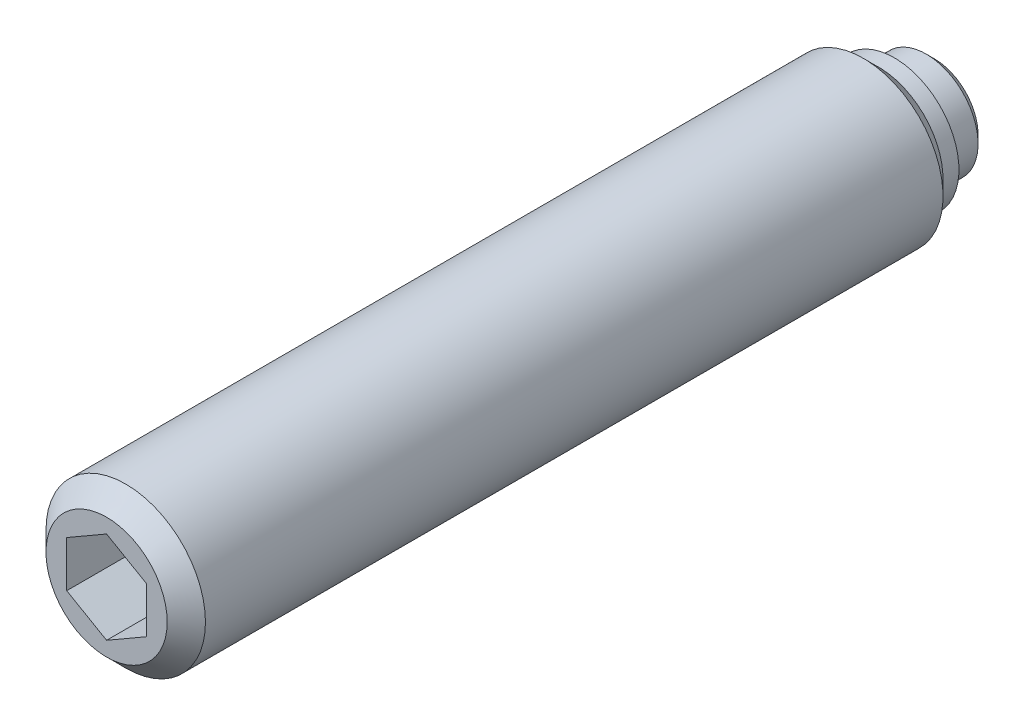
ISO-10303-21;
HEADER;
FILE_DESCRIPTION(('STEP AP214'),'2;1');
FILE_NAME('part.step','',(''),(''),'','','');
FILE_SCHEMA(('AUTOMOTIVE_DESIGN { 1 0 10303 214 1 1 1 1 }'));
ENDSEC;
DATA;
#1=APPLICATION_CONTEXT('core data for automotive mechanical design processes');
#2=APPLICATION_PROTOCOL_DEFINITION('international standard','automotive_design',2000,#1);
#3=PRODUCT_CONTEXT('',#1,'mechanical');
#4=PRODUCT('Part','Part','',(#3));
#5=PRODUCT_RELATED_PRODUCT_CATEGORY('part','',(#4));
#6=PRODUCT_DEFINITION_FORMATION('','',#4);
#7=PRODUCT_DEFINITION_CONTEXT('part definition',#1,'design');
#8=PRODUCT_DEFINITION('design','',#6,#7);
#9=PRODUCT_DEFINITION_SHAPE('','',#8);
#10=(LENGTH_UNIT() NAMED_UNIT(*) SI_UNIT(.MILLI.,.METRE.));
#11=(NAMED_UNIT(*) PLANE_ANGLE_UNIT() SI_UNIT($,.RADIAN.));
#12=(NAMED_UNIT(*) SI_UNIT($,.STERADIAN.) SOLID_ANGLE_UNIT());
#13=UNCERTAINTY_MEASURE_WITH_UNIT(LENGTH_MEASURE(1.E-05),#10,'distance_accuracy_value','');
#14=(GEOMETRIC_REPRESENTATION_CONTEXT(3) GLOBAL_UNCERTAINTY_ASSIGNED_CONTEXT((#13)) GLOBAL_UNIT_ASSIGNED_CONTEXT((#10,
#11,#12)) REPRESENTATION_CONTEXT('',''));
#15=CARTESIAN_POINT('',(0.,0.,0.));
#16=DIRECTION('',(0.,0.,1.));
#17=DIRECTION('',(1.,0.,0.));
#18=AXIS2_PLACEMENT_3D('',#15,#16,#17);
#19=CARTESIAN_POINT('',(0.,0.,0.));
#20=DIRECTION('',(0.,0.,-1.));
#21=DIRECTION('',(-1.,0.,0.));
#22=AXIS2_PLACEMENT_3D('',#19,#20,#21);
#23=CYLINDRICAL_SURFACE('',#22,3.25);
#24=CARTESIAN_POINT('',(0.,0.,0.5));
#25=DIRECTION('',(0.,0.,-1.));
#26=DIRECTION('',(-1.,0.,0.));
#27=AXIS2_PLACEMENT_3D('',#24,#25,#26);
#28=CIRCLE('',#27,3.25);
#29=CARTESIAN_POINT('',(-3.25,0.,0.5));
#30=VERTEX_POINT('',#29);
#31=EDGE_CURVE('E133',#30,#30,#28,.T.);
#32=ORIENTED_EDGE('',*,*,#31,.F.);
#33=EDGE_LOOP('',(#32));
#34=FACE_BOUND('',#33,.T.);
#35=CARTESIAN_POINT('',(0.,0.,2.5));
#36=DIRECTION('',(0.,0.,-1.));
#37=DIRECTION('',(-1.,0.,0.));
#38=AXIS2_PLACEMENT_3D('',#35,#36,#37);
#39=CIRCLE('',#38,3.25);
#40=CARTESIAN_POINT('',(-3.25,0.,2.5));
#41=VERTEX_POINT('',#40);
#42=EDGE_CURVE('E127',#41,#41,#39,.T.);
#43=ORIENTED_EDGE('',*,*,#42,.T.);
#44=EDGE_LOOP('',(#43));
#45=FACE_BOUND('',#44,.T.);
#46=ADVANCED_FACE('F14',(#34,#45),#23,.T.);
#47=CARTESIAN_POINT('',(0.,0.,0.5));
#48=DIRECTION('',(0.,0.,1.));
#49=DIRECTION('',(1.,0.,0.));
#50=AXIS2_PLACEMENT_3D('',#47,#48,#49);
#51=CONICAL_SURFACE('',#50,3.25,0.785398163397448);
#52=CARTESIAN_POINT('',(0.,0.,0.));
#53=DIRECTION('',(0.,0.,-1.));
#54=DIRECTION('',(-1.,0.,0.));
#55=AXIS2_PLACEMENT_3D('',#52,#53,#54);
#56=CIRCLE('',#55,2.75);
#57=CARTESIAN_POINT('',(-2.75,0.,0.));
#58=VERTEX_POINT('',#57);
#59=EDGE_CURVE('E130',#58,#58,#56,.T.);
#60=ORIENTED_EDGE('',*,*,#59,.F.);
#61=EDGE_LOOP('',(#60));
#62=FACE_BOUND('',#61,.T.);
#63=ORIENTED_EDGE('',*,*,#31,.T.);
#64=EDGE_LOOP('',(#63));
#65=FACE_BOUND('',#64,.T.);
#66=ADVANCED_FACE('F159',(#62,#65),#51,.T.);
#67=CARTESIAN_POINT('',(0.,2.75,0.));
#68=DIRECTION('',(0.,0.,1.));
#69=DIRECTION('',(1.,0.,0.));
#70=AXIS2_PLACEMENT_3D('',#67,#68,#69);
#71=PLANE('',#70);
#72=ORIENTED_EDGE('',*,*,#59,.T.);
#73=EDGE_LOOP('',(#72));
#74=FACE_BOUND('',#73,.T.);
#75=ADVANCED_FACE('F165',(#74),#71,.F.);
#76=CARTESIAN_POINT('',(0.,0.,2.5));
#77=DIRECTION('',(0.,0.,-1.));
#78=DIRECTION('',(-1.,0.,0.));
#79=AXIS2_PLACEMENT_3D('',#76,#77,#78);
#80=CYLINDRICAL_SURFACE('',#79,5.);
#81=CARTESIAN_POINT('',(0.,0.,4.45));
#82=DIRECTION('',(0.,0.,-1.));
#83=DIRECTION('',(-1.,0.,0.));
#84=AXIS2_PLACEMENT_3D('',#81,#82,#83);
#85=CIRCLE('',#84,5.);
#86=CARTESIAN_POINT('',(-5.,0.,4.45));
#87=VERTEX_POINT('',#86);
#88=EDGE_CURVE('E9',#87,#87,#85,.T.);
#89=ORIENTED_EDGE('',*,*,#88,.F.);
#90=EDGE_LOOP('',(#89));
#91=FACE_BOUND('',#90,.T.);
#92=CARTESIAN_POINT('',(0.,0.,50.7));
#93=DIRECTION('',(0.,0.,1.));
#94=DIRECTION('',(1.,0.,0.));
#95=AXIS2_PLACEMENT_3D('',#92,#93,#94);
#96=CIRCLE('',#95,5.);
#97=CARTESIAN_POINT('',(5.,0.,50.7));
#98=VERTEX_POINT('',#97);
#99=EDGE_CURVE('E124',#98,#98,#96,.T.);
#100=ORIENTED_EDGE('',*,*,#99,.F.);
#101=EDGE_LOOP('',(#100));
#102=FACE_BOUND('',#101,.T.);
#103=ADVANCED_FACE('F16',(#91,#102),#80,.T.);
#104=CARTESIAN_POINT('',(0.,4.05,2.5));
#105=DIRECTION('',(0.,0.,1.));
#106=DIRECTION('',(1.,0.,0.));
#107=AXIS2_PLACEMENT_3D('',#104,#105,#106);
#108=PLANE('',#107);
#109=CARTESIAN_POINT('',(0.,0.,2.5));
#110=DIRECTION('',(0.,0.,-1.));
#111=DIRECTION('',(-1.,0.,0.));
#112=AXIS2_PLACEMENT_3D('',#109,#110,#111);
#113=CIRCLE('',#112,4.05);
#114=CARTESIAN_POINT('',(-4.05,0.,2.5));
#115=VERTEX_POINT('',#114);
#116=EDGE_CURVE('E136',#115,#115,#113,.T.);
#117=ORIENTED_EDGE('',*,*,#116,.T.);
#118=EDGE_LOOP('',(#117));
#119=FACE_BOUND('',#118,.T.);
#120=ORIENTED_EDGE('',*,*,#42,.F.);
#121=EDGE_LOOP('',(#120));
#122=FACE_BOUND('',#121,.T.);
#123=ADVANCED_FACE('F156',(#119,#122),#108,.F.);
#124=CARTESIAN_POINT('',(0.,0.,2.5));
#125=DIRECTION('',(0.,0.,-1.));
#126=DIRECTION('',(-1.,0.,0.));
#127=AXIS2_PLACEMENT_3D('',#124,#125,#126);
#128=CYLINDRICAL_SURFACE('',#127,4.05);
#129=CARTESIAN_POINT('',(0.,0.,3.5));
#130=DIRECTION('',(0.,0.,-1.));
#131=DIRECTION('',(-1.,0.,0.));
#132=AXIS2_PLACEMENT_3D('',#129,#130,#131);
#133=CIRCLE('',#132,4.05);
#134=CARTESIAN_POINT('',(-4.05,0.,3.5));
#135=VERTEX_POINT('',#134);
#136=EDGE_CURVE('E22',#135,#135,#133,.T.);
#137=ORIENTED_EDGE('',*,*,#136,.T.);
#138=EDGE_LOOP('',(#137));
#139=FACE_BOUND('',#138,.T.);
#140=ORIENTED_EDGE('',*,*,#116,.F.);
#141=EDGE_LOOP('',(#140));
#142=FACE_BOUND('',#141,.T.);
#143=ADVANCED_FACE('F141',(#139,#142),#128,.T.);
#144=CARTESIAN_POINT('',(0.,0.,4.45));
#145=DIRECTION('',(0.,0.,1.));
#146=DIRECTION('',(1.,0.,0.));
#147=AXIS2_PLACEMENT_3D('',#144,#145,#146);
#148=CONICAL_SURFACE('',#147,5.,0.785398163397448);
#149=ORIENTED_EDGE('',*,*,#88,.T.);
#150=EDGE_LOOP('',(#149));
#151=FACE_BOUND('',#150,.T.);
#152=ORIENTED_EDGE('',*,*,#136,.F.);
#153=EDGE_LOOP('',(#152));
#154=FACE_BOUND('',#153,.T.);
#155=ADVANCED_FACE('F144',(#151,#154),#148,.T.);
#156=CARTESIAN_POINT('',(0.,-3.8,51.9));
#157=DIRECTION('',(0.,0.,1.));
#158=DIRECTION('',(1.,0.,0.));
#159=AXIS2_PLACEMENT_3D('',#156,#157,#158);
#160=PLANE('',#159);
#161=DIRECTION('',(0.866025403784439,-0.5,0.));
#162=VECTOR('',#161,1.);
#163=CARTESIAN_POINT('',(-2.5,-1.44337567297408,51.9));
#164=LINE('',#163,#162);
#165=CARTESIAN_POINT('',(-2.5,-1.44337567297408,51.9));
#166=VERTEX_POINT('',#165);
#167=CARTESIAN_POINT('',(0.,-2.88675134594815,51.9));
#168=VERTEX_POINT('',#167);
#169=EDGE_CURVE('E29',#166,#168,#164,.T.);
#170=ORIENTED_EDGE('',*,*,#169,.F.);
#171=DIRECTION('',(0.,-1.,0.));
#172=VECTOR('',#171,1.);
#173=CARTESIAN_POINT('',(-2.5,1.44337567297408,51.9));
#174=LINE('',#173,#172);
#175=CARTESIAN_POINT('',(-2.5,1.44337567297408,51.9));
#176=VERTEX_POINT('',#175);
#177=EDGE_CURVE('E112',#176,#166,#174,.T.);
#178=ORIENTED_EDGE('',*,*,#177,.F.);
#179=DIRECTION('',(-0.866025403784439,-0.5,0.));
#180=VECTOR('',#179,1.);
#181=CARTESIAN_POINT('',(0.,2.88675134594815,51.9));
#182=LINE('',#181,#180);
#183=CARTESIAN_POINT('',(0.,2.88675134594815,51.9));
#184=VERTEX_POINT('',#183);
#185=EDGE_CURVE('E110',#184,#176,#182,.T.);
#186=ORIENTED_EDGE('',*,*,#185,.F.);
#187=DIRECTION('',(-0.866025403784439,0.5,0.));
#188=VECTOR('',#187,1.);
#189=CARTESIAN_POINT('',(2.5,1.44337567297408,51.9));
#190=LINE('',#189,#188);
#191=CARTESIAN_POINT('',(2.5,1.44337567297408,51.9));
#192=VERTEX_POINT('',#191);
#193=EDGE_CURVE('E77',#192,#184,#190,.T.);
#194=ORIENTED_EDGE('',*,*,#193,.F.);
#195=DIRECTION('',(0.,1.,0.));
#196=VECTOR('',#195,1.);
#197=CARTESIAN_POINT('',(2.5,-1.44337567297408,51.9));
#198=LINE('',#197,#196);
#199=CARTESIAN_POINT('',(2.5,-1.44337567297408,51.9));
#200=VERTEX_POINT('',#199);
#201=EDGE_CURVE('E106',#200,#192,#198,.T.);
#202=ORIENTED_EDGE('',*,*,#201,.F.);
#203=DIRECTION('',(0.866025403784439,0.5,0.));
#204=VECTOR('',#203,1.);
#205=CARTESIAN_POINT('',(0.,-2.88675134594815,51.9));
#206=LINE('',#205,#204);
#207=EDGE_CURVE('E103',#168,#200,#206,.T.);
#208=ORIENTED_EDGE('',*,*,#207,.F.);
#209=EDGE_LOOP('',(#170,#178,#186,#194,#202,#208));
#210=FACE_BOUND('',#209,.T.);
#211=CARTESIAN_POINT('',(0.,0.,51.9));
#212=DIRECTION('',(0.,0.,1.));
#213=DIRECTION('',(1.,0.,0.));
#214=AXIS2_PLACEMENT_3D('',#211,#212,#213);
#215=CIRCLE('',#214,3.8);
#216=CARTESIAN_POINT('',(3.8,0.,51.9));
#217=VERTEX_POINT('',#216);
#218=EDGE_CURVE('E116',#217,#217,#215,.T.);
#219=ORIENTED_EDGE('',*,*,#218,.T.);
#220=EDGE_LOOP('',(#219));
#221=FACE_BOUND('',#220,.T.);
#222=ADVANCED_FACE('F146',(#210,#221),#160,.T.);
#223=CARTESIAN_POINT('',(0.,0.,51.9));
#224=DIRECTION('',(0.,0.,-1.));
#225=DIRECTION('',(-1.,0.,0.));
#226=AXIS2_PLACEMENT_3D('',#223,#224,#225);
#227=CONICAL_SURFACE('',#226,3.8,0.785398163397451);
#228=ORIENTED_EDGE('',*,*,#99,.T.);
#229=EDGE_LOOP('',(#228));
#230=FACE_BOUND('',#229,.T.);
#231=ORIENTED_EDGE('',*,*,#218,.F.);
#232=EDGE_LOOP('',(#231));
#233=FACE_BOUND('',#232,.T.);
#234=ADVANCED_FACE('F153',(#230,#233),#227,.T.);
#235=CARTESIAN_POINT('',(-2.5,-1.44337567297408,45.9));
#236=DIRECTION('',(-0.5,-0.866025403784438,0.));
#237=DIRECTION('',(0.866025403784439,-0.5,0.));
#238=AXIS2_PLACEMENT_3D('',#235,#236,#237);
#239=PLANE('',#238);
#240=ORIENTED_EDGE('',*,*,#169,.T.);
#241=DIRECTION('',(0.,0.,1.));
#242=VECTOR('',#241,1.);
#243=CARTESIAN_POINT('',(0.,-2.88675134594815,45.9));
#244=LINE('',#243,#242);
#245=CARTESIAN_POINT('',(0.,-2.88675134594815,45.9));
#246=VERTEX_POINT('',#245);
#247=EDGE_CURVE('E59',#246,#168,#244,.T.);
#248=ORIENTED_EDGE('',*,*,#247,.F.);
#249=DIRECTION('',(0.866025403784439,-0.5,0.));
#250=VECTOR('',#249,1.);
#251=CARTESIAN_POINT('',(-2.5,-1.44337567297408,45.9));
#252=LINE('',#251,#250);
#253=CARTESIAN_POINT('',(-2.5,-1.44337567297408,45.9));
#254=VERTEX_POINT('',#253);
#255=EDGE_CURVE('E114',#254,#246,#252,.T.);
#256=ORIENTED_EDGE('',*,*,#255,.F.);
#257=DIRECTION('',(0.,0.,1.));
#258=VECTOR('',#257,1.);
#259=CARTESIAN_POINT('',(-2.5,-1.44337567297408,45.9));
#260=LINE('',#259,#258);
#261=EDGE_CURVE('E37',#254,#166,#260,.T.);
#262=ORIENTED_EDGE('',*,*,#261,.T.);
#263=EDGE_LOOP('',(#240,#248,#256,#262));
#264=FACE_BOUND('',#263,.T.);
#265=ADVANCED_FACE('F191',(#264),#239,.F.);
#266=CARTESIAN_POINT('',(-2.5,1.44337567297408,45.9));
#267=DIRECTION('',(-1.,0.,0.));
#268=DIRECTION('',(0.,0.,1.));
#269=AXIS2_PLACEMENT_3D('',#266,#267,#268);
#270=PLANE('',#269);
#271=ORIENTED_EDGE('',*,*,#177,.T.);
#272=ORIENTED_EDGE('',*,*,#261,.F.);
#273=DIRECTION('',(0.,-1.,0.));
#274=VECTOR('',#273,1.);
#275=CARTESIAN_POINT('',(-2.5,1.44337567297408,45.9));
#276=LINE('',#275,#274);
#277=CARTESIAN_POINT('',(-2.5,1.44337567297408,45.9));
#278=VERTEX_POINT('',#277);
#279=EDGE_CURVE('E89',#278,#254,#276,.T.);
#280=ORIENTED_EDGE('',*,*,#279,.F.);
#281=DIRECTION('',(0.,0.,1.));
#282=VECTOR('',#281,1.);
#283=CARTESIAN_POINT('',(-2.5,1.44337567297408,45.9));
#284=LINE('',#283,#282);
#285=EDGE_CURVE('E81',#278,#176,#284,.T.);
#286=ORIENTED_EDGE('',*,*,#285,.T.);
#287=EDGE_LOOP('',(#271,#272,#280,#286));
#288=FACE_BOUND('',#287,.T.);
#289=ADVANCED_FACE('F198',(#288),#270,.F.);
#290=CARTESIAN_POINT('',(0.,2.88675134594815,45.9));
#291=DIRECTION('',(-0.5,0.866025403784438,0.));
#292=DIRECTION('',(-0.866025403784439,-0.5,0.));
#293=AXIS2_PLACEMENT_3D('',#290,#291,#292);
#294=PLANE('',#293);
#295=ORIENTED_EDGE('',*,*,#185,.T.);
#296=ORIENTED_EDGE('',*,*,#285,.F.);
#297=DIRECTION('',(-0.866025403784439,-0.5,0.));
#298=VECTOR('',#297,1.);
#299=CARTESIAN_POINT('',(0.,2.88675134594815,45.9));
#300=LINE('',#299,#298);
#301=CARTESIAN_POINT('',(0.,2.88675134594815,45.9));
#302=VERTEX_POINT('',#301);
#303=EDGE_CURVE('E85',#302,#278,#300,.T.);
#304=ORIENTED_EDGE('',*,*,#303,.F.);
#305=DIRECTION('',(0.,0.,1.));
#306=VECTOR('',#305,1.);
#307=CARTESIAN_POINT('',(0.,2.88675134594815,45.9));
#308=LINE('',#307,#306);
#309=EDGE_CURVE('E70',#302,#184,#308,.T.);
#310=ORIENTED_EDGE('',*,*,#309,.T.);
#311=EDGE_LOOP('',(#295,#296,#304,#310));
#312=FACE_BOUND('',#311,.T.);
#313=ADVANCED_FACE('F86',(#312),#294,.F.);
#314=CARTESIAN_POINT('',(2.5,1.44337567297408,45.9));
#315=DIRECTION('',(0.5,0.866025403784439,0.));
#316=DIRECTION('',(-0.866025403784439,0.5,0.));
#317=AXIS2_PLACEMENT_3D('',#314,#315,#316);
#318=PLANE('',#317);
#319=ORIENTED_EDGE('',*,*,#193,.T.);
#320=ORIENTED_EDGE('',*,*,#309,.F.);
#321=DIRECTION('',(-0.866025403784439,0.5,0.));
#322=VECTOR('',#321,1.);
#323=CARTESIAN_POINT('',(2.5,1.44337567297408,45.9));
#324=LINE('',#323,#322);
#325=CARTESIAN_POINT('',(2.5,1.44337567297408,45.9));
#326=VERTEX_POINT('',#325);
#327=EDGE_CURVE('E74',#326,#302,#324,.T.);
#328=ORIENTED_EDGE('',*,*,#327,.F.);
#329=DIRECTION('',(0.,0.,1.));
#330=VECTOR('',#329,1.);
#331=CARTESIAN_POINT('',(2.5,1.44337567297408,45.9));
#332=LINE('',#331,#330);
#333=EDGE_CURVE('E82',#326,#192,#332,.T.);
#334=ORIENTED_EDGE('',*,*,#333,.T.);
#335=EDGE_LOOP('',(#319,#320,#328,#334));
#336=FACE_BOUND('',#335,.T.);
#337=ADVANCED_FACE('F72',(#336),#318,.F.);
#338=CARTESIAN_POINT('',(2.5,-1.44337567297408,45.9));
#339=DIRECTION('',(1.,0.,0.));
#340=DIRECTION('',(0.,1.,0.));
#341=AXIS2_PLACEMENT_3D('',#338,#339,#340);
#342=PLANE('',#341);
#343=ORIENTED_EDGE('',*,*,#201,.T.);
#344=ORIENTED_EDGE('',*,*,#333,.F.);
#345=DIRECTION('',(0.,1.,0.));
#346=VECTOR('',#345,1.);
#347=CARTESIAN_POINT('',(2.5,-1.44337567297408,45.9));
#348=LINE('',#347,#346);
#349=CARTESIAN_POINT('',(2.5,-1.44337567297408,45.9));
#350=VERTEX_POINT('',#349);
#351=EDGE_CURVE('E95',#350,#326,#348,.T.);
#352=ORIENTED_EDGE('',*,*,#351,.F.);
#353=DIRECTION('',(0.,0.,1.));
#354=VECTOR('',#353,1.);
#355=CARTESIAN_POINT('',(2.5,-1.44337567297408,45.9));
#356=LINE('',#355,#354);
#357=EDGE_CURVE('E119',#350,#200,#356,.T.);
#358=ORIENTED_EDGE('',*,*,#357,.T.);
#359=EDGE_LOOP('',(#343,#344,#352,#358));
#360=FACE_BOUND('',#359,.T.);
#361=ADVANCED_FACE('F204',(#360),#342,.F.);
#362=CARTESIAN_POINT('',(0.,-2.88675134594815,45.9));
#363=DIRECTION('',(0.5,-0.866025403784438,0.));
#364=DIRECTION('',(0.866025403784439,0.5,0.));
#365=AXIS2_PLACEMENT_3D('',#362,#363,#364);
#366=PLANE('',#365);
#367=ORIENTED_EDGE('',*,*,#207,.T.);
#368=ORIENTED_EDGE('',*,*,#357,.F.);
#369=DIRECTION('',(0.866025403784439,0.5,0.));
#370=VECTOR('',#369,1.);
#371=CARTESIAN_POINT('',(0.,-2.88675134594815,45.9));
#372=LINE('',#371,#370);
#373=EDGE_CURVE('E97',#246,#350,#372,.T.);
#374=ORIENTED_EDGE('',*,*,#373,.F.);
#375=ORIENTED_EDGE('',*,*,#247,.T.);
#376=EDGE_LOOP('',(#367,#368,#374,#375));
#377=FACE_BOUND('',#376,.T.);
#378=ADVANCED_FACE('F201',(#377),#366,.F.);
#379=CARTESIAN_POINT('',(0.,0.,45.9));
#380=DIRECTION('',(0.,0.,1.));
#381=DIRECTION('',(1.,0.,0.));
#382=AXIS2_PLACEMENT_3D('',#379,#380,#381);
#383=PLANE('',#382);
#384=ORIENTED_EDGE('',*,*,#255,.T.);
#385=ORIENTED_EDGE('',*,*,#373,.T.);
#386=ORIENTED_EDGE('',*,*,#351,.T.);
#387=ORIENTED_EDGE('',*,*,#327,.T.);
#388=ORIENTED_EDGE('',*,*,#303,.T.);
#389=ORIENTED_EDGE('',*,*,#279,.T.);
#390=EDGE_LOOP('',(#384,#385,#386,#387,#388,#389));
#391=FACE_BOUND('',#390,.T.);
#392=ADVANCED_FACE('F92',(#391),#383,.T.);
#393=CLOSED_SHELL('',(#46,#66,#75,#103,#123,#143,#155,#222,#234,#265,#289,#313,#337,#361,#378,#392));
#394=MANIFOLD_SOLID_BREP('B1',#393);
#395=ADVANCED_BREP_SHAPE_REPRESENTATION('',(#18,#394),#14);
#396=SHAPE_DEFINITION_REPRESENTATION(#9,#395);
ENDSEC;
END-ISO-10303-21;
